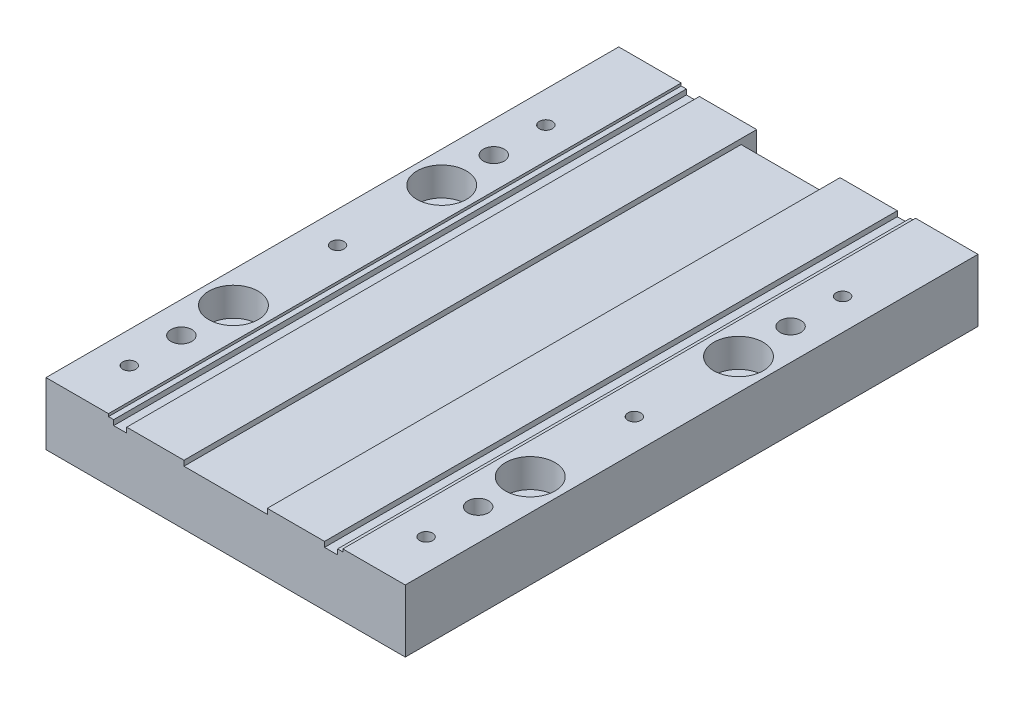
ISO-10303-21;
HEADER;
FILE_DESCRIPTION(('STEP AP214'),'2;1');
FILE_NAME('part.step','',(''),(''),'','','');
FILE_SCHEMA(('AUTOMOTIVE_DESIGN { 1 0 10303 214 1 1 1 1 }'));
ENDSEC;
DATA;
#1=APPLICATION_CONTEXT('core data for automotive mechanical design processes');
#2=APPLICATION_PROTOCOL_DEFINITION('international standard','automotive_design',2000,#1);
#3=PRODUCT_CONTEXT('',#1,'mechanical');
#4=PRODUCT('Part','Part','',(#3));
#5=PRODUCT_RELATED_PRODUCT_CATEGORY('part','',(#4));
#6=PRODUCT_DEFINITION_FORMATION('','',#4);
#7=PRODUCT_DEFINITION_CONTEXT('part definition',#1,'design');
#8=PRODUCT_DEFINITION('design','',#6,#7);
#9=PRODUCT_DEFINITION_SHAPE('','',#8);
#10=(LENGTH_UNIT() NAMED_UNIT(*) SI_UNIT(.MILLI.,.METRE.));
#11=(NAMED_UNIT(*) PLANE_ANGLE_UNIT() SI_UNIT($,.RADIAN.));
#12=(NAMED_UNIT(*) SI_UNIT($,.STERADIAN.) SOLID_ANGLE_UNIT());
#13=UNCERTAINTY_MEASURE_WITH_UNIT(LENGTH_MEASURE(1.E-05),#10,'distance_accuracy_value','');
#14=(GEOMETRIC_REPRESENTATION_CONTEXT(3) GLOBAL_UNCERTAINTY_ASSIGNED_CONTEXT((#13)) GLOBAL_UNIT_ASSIGNED_CONTEXT((#10,
#11,#12)) REPRESENTATION_CONTEXT('',''));
#15=CARTESIAN_POINT('',(0.,0.,0.));
#16=DIRECTION('',(0.,0.,1.));
#17=DIRECTION('',(1.,0.,0.));
#18=AXIS2_PLACEMENT_3D('',#15,#16,#17);
#19=CARTESIAN_POINT('',(6.,-97.9999999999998,40.));
#20=DIRECTION('',(0.,1.,0.));
#21=DIRECTION('',(0.,0.,1.));
#22=AXIS2_PLACEMENT_3D('',#19,#20,#21);
#23=CYLINDRICAL_SURFACE('',#22,2.75);
#24=CARTESIAN_POINT('',(6.,2.22044604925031E-13,40.));
#25=DIRECTION('',(0.,1.,0.));
#26=DIRECTION('',(0.,0.,1.));
#27=AXIS2_PLACEMENT_3D('',#24,#25,#26);
#28=CIRCLE('',#27,2.75);
#29=CARTESIAN_POINT('',(6.,2.22044604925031E-13,42.75));
#30=VERTEX_POINT('',#29);
#31=EDGE_CURVE('E231',#30,#30,#28,.T.);
#32=ORIENTED_EDGE('',*,*,#31,.F.);
#33=EDGE_LOOP('',(#32));
#34=FACE_BOUND('',#33,.T.);
#35=CARTESIAN_POINT('',(6.,6.50000000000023,40.));
#36=DIRECTION('',(0.,1.,0.));
#37=DIRECTION('',(0.,0.,1.));
#38=AXIS2_PLACEMENT_3D('',#35,#36,#37);
#39=CIRCLE('',#38,2.75);
#40=CARTESIAN_POINT('',(6.,6.50000000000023,42.75));
#41=VERTEX_POINT('',#40);
#42=EDGE_CURVE('E249',#41,#41,#39,.F.);
#43=ORIENTED_EDGE('',*,*,#42,.F.);
#44=EDGE_LOOP('',(#43));
#45=FACE_BOUND('',#44,.T.);
#46=ADVANCED_FACE('F32',(#34,#45),#23,.F.);
#47=CARTESIAN_POINT('',(63.,-97.9999999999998,40.));
#48=DIRECTION('',(0.,1.,0.));
#49=DIRECTION('',(0.,0.,1.));
#50=AXIS2_PLACEMENT_3D('',#47,#48,#49);
#51=CYLINDRICAL_SURFACE('',#50,2.75);
#52=CARTESIAN_POINT('',(63.,2.22044604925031E-13,40.));
#53=DIRECTION('',(0.,1.,0.));
#54=DIRECTION('',(0.,0.,1.));
#55=AXIS2_PLACEMENT_3D('',#52,#53,#54);
#56=CIRCLE('',#55,2.75);
#57=CARTESIAN_POINT('',(63.,2.22044604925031E-13,42.75));
#58=VERTEX_POINT('',#57);
#59=EDGE_CURVE('E234',#58,#58,#56,.T.);
#60=ORIENTED_EDGE('',*,*,#59,.F.);
#61=EDGE_LOOP('',(#60));
#62=FACE_BOUND('',#61,.T.);
#63=CARTESIAN_POINT('',(63.,6.50000000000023,40.));
#64=DIRECTION('',(0.,1.,0.));
#65=DIRECTION('',(0.,0.,1.));
#66=AXIS2_PLACEMENT_3D('',#63,#64,#65);
#67=CIRCLE('',#66,2.75);
#68=CARTESIAN_POINT('',(63.,6.50000000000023,42.75));
#69=VERTEX_POINT('',#68);
#70=EDGE_CURVE('E244',#69,#69,#67,.F.);
#71=ORIENTED_EDGE('',*,*,#70,.F.);
#72=EDGE_LOOP('',(#71));
#73=FACE_BOUND('',#72,.T.);
#74=ADVANCED_FACE('F468',(#62,#73),#51,.F.);
#75=CARTESIAN_POINT('',(63.,-97.9999999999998,80.));
#76=DIRECTION('',(0.,1.,0.));
#77=DIRECTION('',(0.,0.,1.));
#78=AXIS2_PLACEMENT_3D('',#75,#76,#77);
#79=CYLINDRICAL_SURFACE('',#78,2.75);
#80=CARTESIAN_POINT('',(63.,2.22044604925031E-13,80.));
#81=DIRECTION('',(0.,1.,0.));
#82=DIRECTION('',(0.,0.,1.));
#83=AXIS2_PLACEMENT_3D('',#80,#81,#82);
#84=CIRCLE('',#83,2.75);
#85=CARTESIAN_POINT('',(63.,2.22044604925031E-13,82.75));
#86=VERTEX_POINT('',#85);
#87=EDGE_CURVE('E230',#86,#86,#84,.T.);
#88=ORIENTED_EDGE('',*,*,#87,.F.);
#89=EDGE_LOOP('',(#88));
#90=FACE_BOUND('',#89,.T.);
#91=CARTESIAN_POINT('',(63.,6.50000000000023,80.));
#92=DIRECTION('',(0.,1.,0.));
#93=DIRECTION('',(0.,0.,1.));
#94=AXIS2_PLACEMENT_3D('',#91,#92,#93);
#95=CIRCLE('',#94,2.75);
#96=CARTESIAN_POINT('',(63.,6.50000000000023,82.75));
#97=VERTEX_POINT('',#96);
#98=EDGE_CURVE('E239',#97,#97,#95,.F.);
#99=ORIENTED_EDGE('',*,*,#98,.F.);
#100=EDGE_LOOP('',(#99));
#101=FACE_BOUND('',#100,.T.);
#102=ADVANCED_FACE('F474',(#90,#101),#79,.F.);
#103=CARTESIAN_POINT('',(6.,-97.9999999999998,80.));
#104=DIRECTION('',(0.,1.,0.));
#105=DIRECTION('',(0.,0.,1.));
#106=AXIS2_PLACEMENT_3D('',#103,#104,#105);
#107=CYLINDRICAL_SURFACE('',#106,2.75);
#108=CARTESIAN_POINT('',(6.,2.22044604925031E-13,80.));
#109=DIRECTION('',(0.,1.,0.));
#110=DIRECTION('',(0.,0.,1.));
#111=AXIS2_PLACEMENT_3D('',#108,#109,#110);
#112=CIRCLE('',#111,2.75);
#113=CARTESIAN_POINT('',(6.,2.22044604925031E-13,82.75));
#114=VERTEX_POINT('',#113);
#115=EDGE_CURVE('E226',#114,#114,#112,.T.);
#116=ORIENTED_EDGE('',*,*,#115,.F.);
#117=EDGE_LOOP('',(#116));
#118=FACE_BOUND('',#117,.T.);
#119=CARTESIAN_POINT('',(6.,6.50000000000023,80.));
#120=DIRECTION('',(0.,1.,0.));
#121=DIRECTION('',(0.,0.,1.));
#122=AXIS2_PLACEMENT_3D('',#119,#120,#121);
#123=CIRCLE('',#122,2.75);
#124=CARTESIAN_POINT('',(6.,6.50000000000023,82.75));
#125=VERTEX_POINT('',#124);
#126=EDGE_CURVE('E235',#125,#125,#123,.F.);
#127=ORIENTED_EDGE('',*,*,#126,.F.);
#128=EDGE_LOOP('',(#127));
#129=FACE_BOUND('',#128,.T.);
#130=ADVANCED_FACE('F485',(#118,#129),#107,.F.);
#131=CARTESIAN_POINT('',(26.5,10.5000000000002,110.));
#132=DIRECTION('',(-1.,0.,0.));
#133=DIRECTION('',(0.,0.,1.));
#134=AXIS2_PLACEMENT_3D('',#131,#132,#133);
#135=PLANE('',#134);
#136=DIRECTION('',(0.,1.,0.));
#137=VECTOR('',#136,1.);
#138=CARTESIAN_POINT('',(26.5,10.5000000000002,0.));
#139=LINE('',#138,#137);
#140=CARTESIAN_POINT('',(26.5,7.50000000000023,0.));
#141=VERTEX_POINT('',#140);
#142=CARTESIAN_POINT('',(26.5,11.5000000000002,0.));
#143=VERTEX_POINT('',#142);
#144=EDGE_CURVE('E47',#141,#143,#139,.T.);
#145=ORIENTED_EDGE('',*,*,#144,.T.);
#146=DIRECTION('',(0.,0.,-1.));
#147=VECTOR('',#146,1.);
#148=CARTESIAN_POINT('',(26.5,11.5000000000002,110.));
#149=LINE('',#148,#147);
#150=CARTESIAN_POINT('',(26.5,11.5000000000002,110.));
#151=VERTEX_POINT('',#150);
#152=EDGE_CURVE('E179',#151,#143,#149,.T.);
#153=ORIENTED_EDGE('',*,*,#152,.F.);
#154=DIRECTION('',(0.,1.,0.));
#155=VECTOR('',#154,1.);
#156=CARTESIAN_POINT('',(26.5,10.5000000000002,110.));
#157=LINE('',#156,#155);
#158=CARTESIAN_POINT('',(26.5,10.5000000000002,110.));
#159=VERTEX_POINT('',#158);
#160=EDGE_CURVE('E185',#159,#151,#157,.T.);
#161=ORIENTED_EDGE('',*,*,#160,.F.);
#162=DIRECTION('',(0.,0.,-1.));
#163=VECTOR('',#162,1.);
#164=CARTESIAN_POINT('',(26.5,10.5000000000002,110.));
#165=LINE('',#164,#163);
#166=CARTESIAN_POINT('',(26.5,10.5000000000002,2.99999999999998));
#167=VERTEX_POINT('',#166);
#168=EDGE_CURVE('E255',#159,#167,#165,.T.);
#169=ORIENTED_EDGE('',*,*,#168,.T.);
#170=DIRECTION('',(0.,-0.707106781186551,-0.707106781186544));
#171=VECTOR('',#170,1.);
#172=CARTESIAN_POINT('',(26.5,64.0000000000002,56.4999999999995));
#173=LINE('',#172,#171);
#174=EDGE_CURVE('E40',#167,#141,#173,.T.);
#175=ORIENTED_EDGE('',*,*,#174,.T.);
#176=EDGE_LOOP('',(#145,#153,#161,#169,#175));
#177=FACE_BOUND('',#176,.T.);
#178=ADVANCED_FACE('F195',(#177),#135,.F.);
#179=CARTESIAN_POINT('',(15.5000000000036,11.5000000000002,110.));
#180=DIRECTION('',(0.,-1.,0.));
#181=DIRECTION('',(0.,0.,-1.));
#182=AXIS2_PLACEMENT_3D('',#179,#180,#181);
#183=PLANE('',#182);
#184=DIRECTION('',(-1.,0.,0.));
#185=VECTOR('',#184,1.);
#186=CARTESIAN_POINT('',(15.5000000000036,11.5000000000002,0.));
#187=LINE('',#186,#185);
#188=CARTESIAN_POINT('',(15.5000000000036,11.5000000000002,0.));
#189=VERTEX_POINT('',#188);
#190=EDGE_CURVE('E333',#143,#189,#187,.T.);
#191=ORIENTED_EDGE('',*,*,#190,.T.);
#192=DIRECTION('',(0.,0.,-1.));
#193=VECTOR('',#192,1.);
#194=CARTESIAN_POINT('',(15.5000000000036,11.5000000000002,110.));
#195=LINE('',#194,#193);
#196=CARTESIAN_POINT('',(15.5000000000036,11.5000000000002,110.));
#197=VERTEX_POINT('',#196);
#198=EDGE_CURVE('E181',#197,#189,#195,.T.);
#199=ORIENTED_EDGE('',*,*,#198,.F.);
#200=DIRECTION('',(-1.,0.,0.));
#201=VECTOR('',#200,1.);
#202=CARTESIAN_POINT('',(15.5000000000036,11.5000000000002,110.));
#203=LINE('',#202,#201);
#204=EDGE_CURVE('E175',#151,#197,#203,.T.);
#205=ORIENTED_EDGE('',*,*,#204,.F.);
#206=ORIENTED_EDGE('',*,*,#152,.T.);
#207=EDGE_LOOP('',(#191,#199,#205,#206));
#208=FACE_BOUND('',#207,.T.);
#209=ADVANCED_FACE('F177',(#208),#183,.F.);
#210=CARTESIAN_POINT('',(15.5000000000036,11.5000000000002,110.));
#211=DIRECTION('',(1.,0.,0.));
#212=DIRECTION('',(0.,0.,-1.));
#213=AXIS2_PLACEMENT_3D('',#210,#211,#212);
#214=PLANE('',#213);
#215=DIRECTION('',(0.,-1.,0.));
#216=VECTOR('',#215,1.);
#217=CARTESIAN_POINT('',(15.5000000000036,11.5000000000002,0.));
#218=LINE('',#217,#216);
#219=CARTESIAN_POINT('',(15.5000000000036,10.5000000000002,0.));
#220=VERTEX_POINT('',#219);
#221=EDGE_CURVE('E327',#189,#220,#218,.T.);
#222=ORIENTED_EDGE('',*,*,#221,.T.);
#223=DIRECTION('',(0.,0.,-1.));
#224=VECTOR('',#223,1.);
#225=CARTESIAN_POINT('',(15.5000000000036,10.5000000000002,110.));
#226=LINE('',#225,#224);
#227=CARTESIAN_POINT('',(15.5000000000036,10.5000000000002,110.));
#228=VERTEX_POINT('',#227);
#229=EDGE_CURVE('E201',#228,#220,#226,.T.);
#230=ORIENTED_EDGE('',*,*,#229,.F.);
#231=DIRECTION('',(0.,-1.,0.));
#232=VECTOR('',#231,1.);
#233=CARTESIAN_POINT('',(15.5000000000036,11.5000000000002,110.));
#234=LINE('',#233,#232);
#235=EDGE_CURVE('E184',#197,#228,#234,.T.);
#236=ORIENTED_EDGE('',*,*,#235,.F.);
#237=ORIENTED_EDGE('',*,*,#198,.T.);
#238=EDGE_LOOP('',(#222,#230,#236,#237));
#239=FACE_BOUND('',#238,.T.);
#240=ADVANCED_FACE('F378',(#239),#214,.F.);
#241=CARTESIAN_POINT('',(13.0000000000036,10.5000000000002,110.));
#242=DIRECTION('',(0.,-1.,0.));
#243=DIRECTION('',(0.,0.,-1.));
#244=AXIS2_PLACEMENT_3D('',#241,#242,#243);
#245=PLANE('',#244);
#246=DIRECTION('',(-1.,0.,0.));
#247=VECTOR('',#246,1.);
#248=CARTESIAN_POINT('',(13.0000000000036,10.5000000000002,0.));
#249=LINE('',#248,#247);
#250=CARTESIAN_POINT('',(13.0000000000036,10.5000000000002,0.));
#251=VERTEX_POINT('',#250);
#252=EDGE_CURVE('E322',#220,#251,#249,.T.);
#253=ORIENTED_EDGE('',*,*,#252,.T.);
#254=DIRECTION('',(0.,0.,-1.));
#255=VECTOR('',#254,1.);
#256=CARTESIAN_POINT('',(13.0000000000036,10.5000000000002,110.));
#257=LINE('',#256,#255);
#258=CARTESIAN_POINT('',(13.0000000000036,10.5000000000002,110.));
#259=VERTEX_POINT('',#258);
#260=EDGE_CURVE('E313',#259,#251,#257,.T.);
#261=ORIENTED_EDGE('',*,*,#260,.F.);
#262=DIRECTION('',(-1.,0.,0.));
#263=VECTOR('',#262,1.);
#264=CARTESIAN_POINT('',(13.0000000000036,10.5000000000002,110.));
#265=LINE('',#264,#263);
#266=EDGE_CURVE('E323',#228,#259,#265,.T.);
#267=ORIENTED_EDGE('',*,*,#266,.F.);
#268=ORIENTED_EDGE('',*,*,#229,.T.);
#269=EDGE_LOOP('',(#253,#261,#267,#268));
#270=FACE_BOUND('',#269,.T.);
#271=ADVANCED_FACE('F320',(#270),#245,.F.);
#272=CARTESIAN_POINT('',(13.0000000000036,11.5000000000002,110.));
#273=DIRECTION('',(-1.,0.,0.));
#274=DIRECTION('',(0.,0.,1.));
#275=AXIS2_PLACEMENT_3D('',#272,#273,#274);
#276=PLANE('',#275);
#277=DIRECTION('',(0.,1.,0.));
#278=VECTOR('',#277,1.);
#279=CARTESIAN_POINT('',(13.0000000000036,11.5000000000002,0.));
#280=LINE('',#279,#278);
#281=CARTESIAN_POINT('',(13.0000000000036,11.5000000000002,0.));
#282=VERTEX_POINT('',#281);
#283=EDGE_CURVE('E329',#251,#282,#280,.T.);
#284=ORIENTED_EDGE('',*,*,#283,.T.);
#285=DIRECTION('',(0.,0.,-1.));
#286=VECTOR('',#285,1.);
#287=CARTESIAN_POINT('',(13.0000000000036,11.5000000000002,110.));
#288=LINE('',#287,#286);
#289=CARTESIAN_POINT('',(13.0000000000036,11.5000000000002,110.));
#290=VERTEX_POINT('',#289);
#291=EDGE_CURVE('E310',#290,#282,#288,.T.);
#292=ORIENTED_EDGE('',*,*,#291,.F.);
#293=DIRECTION('',(0.,1.,0.));
#294=VECTOR('',#293,1.);
#295=CARTESIAN_POINT('',(13.0000000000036,11.5000000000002,110.));
#296=LINE('',#295,#294);
#297=EDGE_CURVE('E380',#259,#290,#296,.T.);
#298=ORIENTED_EDGE('',*,*,#297,.F.);
#299=ORIENTED_EDGE('',*,*,#260,.T.);
#300=EDGE_LOOP('',(#284,#292,#298,#299));
#301=FACE_BOUND('',#300,.T.);
#302=ADVANCED_FACE('F458',(#301),#276,.F.);
#303=CARTESIAN_POINT('',(12.,11.5000000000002,110.));
#304=DIRECTION('',(0.,-1.,0.));
#305=DIRECTION('',(0.,0.,-1.));
#306=AXIS2_PLACEMENT_3D('',#303,#304,#305);
#307=PLANE('',#306);
#308=DIRECTION('',(-1.,0.,0.));
#309=VECTOR('',#308,1.);
#310=CARTESIAN_POINT('',(12.,11.5000000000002,0.));
#311=LINE('',#310,#309);
#312=CARTESIAN_POINT('',(12.,11.5000000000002,0.));
#313=VERTEX_POINT('',#312);
#314=EDGE_CURVE('E331',#282,#313,#311,.T.);
#315=ORIENTED_EDGE('',*,*,#314,.T.);
#316=DIRECTION('',(0.,0.,-1.));
#317=VECTOR('',#316,1.);
#318=CARTESIAN_POINT('',(12.,11.5000000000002,110.));
#319=LINE('',#318,#317);
#320=CARTESIAN_POINT('',(12.,11.5000000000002,110.));
#321=VERTEX_POINT('',#320);
#322=EDGE_CURVE('E307',#321,#313,#319,.T.);
#323=ORIENTED_EDGE('',*,*,#322,.F.);
#324=DIRECTION('',(-1.,0.,0.));
#325=VECTOR('',#324,1.);
#326=CARTESIAN_POINT('',(12.,11.5000000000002,110.));
#327=LINE('',#326,#325);
#328=EDGE_CURVE('E384',#290,#321,#327,.T.);
#329=ORIENTED_EDGE('',*,*,#328,.F.);
#330=ORIENTED_EDGE('',*,*,#291,.T.);
#331=EDGE_LOOP('',(#315,#323,#329,#330));
#332=FACE_BOUND('',#331,.T.);
#333=ADVANCED_FACE('F453',(#332),#307,.F.);
#334=CARTESIAN_POINT('',(12.,11.5000000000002,110.));
#335=DIRECTION('',(-1.,0.,0.));
#336=DIRECTION('',(0.,0.,1.));
#337=AXIS2_PLACEMENT_3D('',#334,#335,#336);
#338=PLANE('',#337);
#339=DIRECTION('',(0.,1.,0.));
#340=VECTOR('',#339,1.);
#341=CARTESIAN_POINT('',(12.,11.5000000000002,0.));
#342=LINE('',#341,#340);
#343=CARTESIAN_POINT('',(12.,12.0000000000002,0.));
#344=VERTEX_POINT('',#343);
#345=EDGE_CURVE('E338',#313,#344,#342,.T.);
#346=ORIENTED_EDGE('',*,*,#345,.T.);
#347=DIRECTION('',(0.,0.,-1.));
#348=VECTOR('',#347,1.);
#349=CARTESIAN_POINT('',(12.,12.0000000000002,110.));
#350=LINE('',#349,#348);
#351=CARTESIAN_POINT('',(12.,12.0000000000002,110.));
#352=VERTEX_POINT('',#351);
#353=EDGE_CURVE('E304',#352,#344,#350,.T.);
#354=ORIENTED_EDGE('',*,*,#353,.F.);
#355=DIRECTION('',(0.,1.,0.));
#356=VECTOR('',#355,1.);
#357=CARTESIAN_POINT('',(12.,11.5000000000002,110.));
#358=LINE('',#357,#356);
#359=EDGE_CURVE('E386',#321,#352,#358,.T.);
#360=ORIENTED_EDGE('',*,*,#359,.F.);
#361=ORIENTED_EDGE('',*,*,#322,.T.);
#362=EDGE_LOOP('',(#346,#354,#360,#361));
#363=FACE_BOUND('',#362,.T.);
#364=ADVANCED_FACE('F450',(#363),#338,.F.);
#365=CARTESIAN_POINT('',(0.,12.0000000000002,110.));
#366=DIRECTION('',(0.,-1.,0.));
#367=DIRECTION('',(0.,0.,-1.));
#368=AXIS2_PLACEMENT_3D('',#365,#366,#367);
#369=PLANE('',#368);
#370=CARTESIAN_POINT('',(6.,12.0000000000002,40.));
#371=DIRECTION('',(0.,1.,0.));
#372=DIRECTION('',(0.,0.,1.));
#373=AXIS2_PLACEMENT_3D('',#370,#371,#372);
#374=CIRCLE('',#373,4.75);
#375=CARTESIAN_POINT('',(6.,12.0000000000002,44.75));
#376=VERTEX_POINT('',#375);
#377=EDGE_CURVE('E873',#376,#376,#374,.T.);
#378=ORIENTED_EDGE('',*,*,#377,.F.);
#379=EDGE_LOOP('',(#378));
#380=FACE_BOUND('',#379,.T.);
#381=CARTESIAN_POINT('',(6.,12.0000000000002,80.));
#382=DIRECTION('',(0.,1.,0.));
#383=DIRECTION('',(0.,0.,1.));
#384=AXIS2_PLACEMENT_3D('',#381,#382,#383);
#385=CIRCLE('',#384,4.75);
#386=CARTESIAN_POINT('',(6.,12.0000000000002,84.75));
#387=VERTEX_POINT('',#386);
#388=EDGE_CURVE('E242',#387,#387,#385,.T.);
#389=ORIENTED_EDGE('',*,*,#388,.F.);
#390=EDGE_LOOP('',(#389));
#391=FACE_BOUND('',#390,.T.);
#392=CARTESIAN_POINT('',(6.,12.0000000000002,90.));
#393=DIRECTION('',(0.,1.,0.));
#394=DIRECTION('',(0.,0.,1.));
#395=AXIS2_PLACEMENT_3D('',#392,#393,#394);
#396=CIRCLE('',#395,2.00000000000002);
#397=CARTESIAN_POINT('',(6.,12.0000000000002,92.));
#398=VERTEX_POINT('',#397);
#399=EDGE_CURVE('E225',#398,#398,#396,.T.);
#400=ORIENTED_EDGE('',*,*,#399,.F.);
#401=EDGE_LOOP('',(#400));
#402=FACE_BOUND('',#401,.T.);
#403=CARTESIAN_POINT('',(6.,12.0000000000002,30.));
#404=DIRECTION('',(0.,1.,0.));
#405=DIRECTION('',(0.,0.,1.));
#406=AXIS2_PLACEMENT_3D('',#403,#404,#405);
#407=CIRCLE('',#406,2.00000000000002);
#408=CARTESIAN_POINT('',(6.,12.0000000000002,32.));
#409=VERTEX_POINT('',#408);
#410=EDGE_CURVE('E221',#409,#409,#407,.T.);
#411=ORIENTED_EDGE('',*,*,#410,.F.);
#412=EDGE_LOOP('',(#411));
#413=FACE_BOUND('',#412,.T.);
#414=CARTESIAN_POINT('',(6.,12.0000000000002,100.));
#415=DIRECTION('',(0.,1.,0.));
#416=DIRECTION('',(0.,0.,1.));
#417=AXIS2_PLACEMENT_3D('',#414,#415,#416);
#418=CIRCLE('',#417,1.25);
#419=CARTESIAN_POINT('',(6.,12.0000000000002,101.25));
#420=VERTEX_POINT('',#419);
#421=EDGE_CURVE('E216',#420,#420,#418,.T.);
#422=ORIENTED_EDGE('',*,*,#421,.F.);
#423=EDGE_LOOP('',(#422));
#424=FACE_BOUND('',#423,.T.);
#425=CARTESIAN_POINT('',(6.,12.0000000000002,60.));
#426=DIRECTION('',(0.,1.,0.));
#427=DIRECTION('',(0.,0.,1.));
#428=AXIS2_PLACEMENT_3D('',#425,#426,#427);
#429=CIRCLE('',#428,1.25);
#430=CARTESIAN_POINT('',(6.,12.0000000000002,61.25));
#431=VERTEX_POINT('',#430);
#432=EDGE_CURVE('E212',#431,#431,#429,.T.);
#433=ORIENTED_EDGE('',*,*,#432,.F.);
#434=EDGE_LOOP('',(#433));
#435=FACE_BOUND('',#434,.T.);
#436=CARTESIAN_POINT('',(6.,12.0000000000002,20.));
#437=DIRECTION('',(0.,1.,0.));
#438=DIRECTION('',(0.,0.,1.));
#439=AXIS2_PLACEMENT_3D('',#436,#437,#438);
#440=CIRCLE('',#439,1.25);
#441=CARTESIAN_POINT('',(6.,12.0000000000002,21.25));
#442=VERTEX_POINT('',#441);
#443=EDGE_CURVE('E208',#442,#442,#440,.T.);
#444=ORIENTED_EDGE('',*,*,#443,.F.);
#445=EDGE_LOOP('',(#444));
#446=FACE_BOUND('',#445,.T.);
#447=DIRECTION('',(-1.,0.,0.));
#448=VECTOR('',#447,1.);
#449=CARTESIAN_POINT('',(0.,12.0000000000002,0.));
#450=LINE('',#449,#448);
#451=CARTESIAN_POINT('',(0.,12.0000000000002,0.));
#452=VERTEX_POINT('',#451);
#453=EDGE_CURVE('E340',#344,#452,#450,.T.);
#454=ORIENTED_EDGE('',*,*,#453,.T.);
#455=DIRECTION('',(0.,0.,-1.));
#456=VECTOR('',#455,1.);
#457=CARTESIAN_POINT('',(0.,12.0000000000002,110.));
#458=LINE('',#457,#456);
#459=CARTESIAN_POINT('',(0.,12.0000000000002,110.));
#460=VERTEX_POINT('',#459);
#461=EDGE_CURVE('E301',#460,#452,#458,.T.);
#462=ORIENTED_EDGE('',*,*,#461,.F.);
#463=DIRECTION('',(-1.,0.,0.));
#464=VECTOR('',#463,1.);
#465=CARTESIAN_POINT('',(0.,12.0000000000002,110.));
#466=LINE('',#465,#464);
#467=EDGE_CURVE('E388',#352,#460,#466,.T.);
#468=ORIENTED_EDGE('',*,*,#467,.F.);
#469=ORIENTED_EDGE('',*,*,#353,.T.);
#470=EDGE_LOOP('',(#454,#462,#468,#469));
#471=FACE_BOUND('',#470,.T.);
#472=ADVANCED_FACE('F446',(#380,#391,#402,#413,#424,#435,#446,#471),#369,.F.);
#473=CARTESIAN_POINT('',(0.,2.27373675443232E-13,110.));
#474=DIRECTION('',(1.,0.,0.));
#475=DIRECTION('',(0.,0.,-1.));
#476=AXIS2_PLACEMENT_3D('',#473,#474,#475);
#477=PLANE('',#476);
#478=DIRECTION('',(0.,-1.,0.));
#479=VECTOR('',#478,1.);
#480=CARTESIAN_POINT('',(0.,2.27373675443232E-13,0.));
#481=LINE('',#480,#479);
#482=CARTESIAN_POINT('',(0.,2.27373675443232E-13,0.));
#483=VERTEX_POINT('',#482);
#484=EDGE_CURVE('E342',#452,#483,#481,.T.);
#485=ORIENTED_EDGE('',*,*,#484,.T.);
#486=DIRECTION('',(0.,0.,-1.));
#487=VECTOR('',#486,1.);
#488=CARTESIAN_POINT('',(0.,2.27373675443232E-13,110.));
#489=LINE('',#488,#487);
#490=CARTESIAN_POINT('',(0.,2.27373675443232E-13,110.));
#491=VERTEX_POINT('',#490);
#492=EDGE_CURVE('E298',#491,#483,#489,.T.);
#493=ORIENTED_EDGE('',*,*,#492,.F.);
#494=DIRECTION('',(0.,-1.,0.));
#495=VECTOR('',#494,1.);
#496=CARTESIAN_POINT('',(0.,2.27373675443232E-13,110.));
#497=LINE('',#496,#495);
#498=EDGE_CURVE('E390',#460,#491,#497,.T.);
#499=ORIENTED_EDGE('',*,*,#498,.F.);
#500=ORIENTED_EDGE('',*,*,#461,.T.);
#501=EDGE_LOOP('',(#485,#493,#499,#500));
#502=FACE_BOUND('',#501,.T.);
#503=ADVANCED_FACE('F441',(#502),#477,.F.);
#504=CARTESIAN_POINT('',(0.,2.27373675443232E-13,110.));
#505=DIRECTION('',(0.,1.,0.));
#506=DIRECTION('',(0.,0.,1.));
#507=AXIS2_PLACEMENT_3D('',#504,#505,#506);
#508=PLANE('',#507);
#509=ORIENTED_EDGE('',*,*,#31,.T.);
#510=EDGE_LOOP('',(#509));
#511=FACE_BOUND('',#510,.T.);
#512=ORIENTED_EDGE('',*,*,#59,.T.);
#513=EDGE_LOOP('',(#512));
#514=FACE_BOUND('',#513,.T.);
#515=ORIENTED_EDGE('',*,*,#87,.T.);
#516=EDGE_LOOP('',(#515));
#517=FACE_BOUND('',#516,.T.);
#518=ORIENTED_EDGE('',*,*,#115,.T.);
#519=EDGE_LOOP('',(#518));
#520=FACE_BOUND('',#519,.T.);
#521=CARTESIAN_POINT('',(63.,2.22044604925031E-13,30.));
#522=DIRECTION('',(0.,1.,0.));
#523=DIRECTION('',(0.,0.,1.));
#524=AXIS2_PLACEMENT_3D('',#521,#522,#523);
#525=CIRCLE('',#524,2.00000000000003);
#526=CARTESIAN_POINT('',(63.,2.22044604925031E-13,32.));
#527=VERTEX_POINT('',#526);
#528=EDGE_CURVE('E895',#527,#527,#525,.T.);
#529=ORIENTED_EDGE('',*,*,#528,.T.);
#530=EDGE_LOOP('',(#529));
#531=FACE_BOUND('',#530,.T.);
#532=CARTESIAN_POINT('',(63.,2.22044604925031E-13,90.));
#533=DIRECTION('',(0.,1.,0.));
#534=DIRECTION('',(0.,0.,1.));
#535=AXIS2_PLACEMENT_3D('',#532,#533,#534);
#536=CIRCLE('',#535,2.00000000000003);
#537=CARTESIAN_POINT('',(63.,2.22044604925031E-13,92.));
#538=VERTEX_POINT('',#537);
#539=EDGE_CURVE('E901',#538,#538,#536,.T.);
#540=ORIENTED_EDGE('',*,*,#539,.T.);
#541=EDGE_LOOP('',(#540));
#542=FACE_BOUND('',#541,.T.);
#543=CARTESIAN_POINT('',(6.,2.22044604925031E-13,90.));
#544=DIRECTION('',(0.,1.,0.));
#545=DIRECTION('',(0.,0.,1.));
#546=AXIS2_PLACEMENT_3D('',#543,#544,#545);
#547=CIRCLE('',#546,2.00000000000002);
#548=CARTESIAN_POINT('',(6.,2.22044604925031E-13,92.));
#549=VERTEX_POINT('',#548);
#550=EDGE_CURVE('E222',#549,#549,#547,.T.);
#551=ORIENTED_EDGE('',*,*,#550,.T.);
#552=EDGE_LOOP('',(#551));
#553=FACE_BOUND('',#552,.T.);
#554=CARTESIAN_POINT('',(6.,2.22044604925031E-13,30.));
#555=DIRECTION('',(0.,1.,0.));
#556=DIRECTION('',(0.,0.,1.));
#557=AXIS2_PLACEMENT_3D('',#554,#555,#556);
#558=CIRCLE('',#557,2.00000000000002);
#559=CARTESIAN_POINT('',(6.,2.22044604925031E-13,32.));
#560=VERTEX_POINT('',#559);
#561=EDGE_CURVE('E217',#560,#560,#558,.T.);
#562=ORIENTED_EDGE('',*,*,#561,.T.);
#563=EDGE_LOOP('',(#562));
#564=FACE_BOUND('',#563,.T.);
#565=CARTESIAN_POINT('',(63.,2.22044604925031E-13,20.));
#566=DIRECTION('',(0.,1.,0.));
#567=DIRECTION('',(0.,0.,1.));
#568=AXIS2_PLACEMENT_3D('',#565,#566,#567);
#569=CIRCLE('',#568,1.25);
#570=CARTESIAN_POINT('',(63.,2.22044604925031E-13,21.25));
#571=VERTEX_POINT('',#570);
#572=EDGE_CURVE('E910',#571,#571,#569,.T.);
#573=ORIENTED_EDGE('',*,*,#572,.T.);
#574=EDGE_LOOP('',(#573));
#575=FACE_BOUND('',#574,.T.);
#576=CARTESIAN_POINT('',(63.,2.22044604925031E-13,60.));
#577=DIRECTION('',(0.,1.,0.));
#578=DIRECTION('',(0.,0.,1.));
#579=AXIS2_PLACEMENT_3D('',#576,#577,#578);
#580=CIRCLE('',#579,1.25);
#581=CARTESIAN_POINT('',(63.,2.22044604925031E-13,61.25));
#582=VERTEX_POINT('',#581);
#583=EDGE_CURVE('E916',#582,#582,#580,.T.);
#584=ORIENTED_EDGE('',*,*,#583,.T.);
#585=EDGE_LOOP('',(#584));
#586=FACE_BOUND('',#585,.T.);
#587=CARTESIAN_POINT('',(63.,2.22044604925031E-13,100.));
#588=DIRECTION('',(0.,1.,0.));
#589=DIRECTION('',(0.,0.,1.));
#590=AXIS2_PLACEMENT_3D('',#587,#588,#589);
#591=CIRCLE('',#590,1.25);
#592=CARTESIAN_POINT('',(63.,2.22044604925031E-13,101.25));
#593=VERTEX_POINT('',#592);
#594=EDGE_CURVE('E922',#593,#593,#591,.T.);
#595=ORIENTED_EDGE('',*,*,#594,.T.);
#596=EDGE_LOOP('',(#595));
#597=FACE_BOUND('',#596,.T.);
#598=CARTESIAN_POINT('',(6.,2.22044604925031E-13,100.));
#599=DIRECTION('',(0.,1.,0.));
#600=DIRECTION('',(0.,0.,1.));
#601=AXIS2_PLACEMENT_3D('',#598,#599,#600);
#602=CIRCLE('',#601,1.25);
#603=CARTESIAN_POINT('',(6.,2.22044604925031E-13,101.25));
#604=VERTEX_POINT('',#603);
#605=EDGE_CURVE('E213',#604,#604,#602,.T.);
#606=ORIENTED_EDGE('',*,*,#605,.T.);
#607=EDGE_LOOP('',(#606));
#608=FACE_BOUND('',#607,.T.);
#609=CARTESIAN_POINT('',(6.,2.22044604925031E-13,60.));
#610=DIRECTION('',(0.,1.,0.));
#611=DIRECTION('',(0.,0.,1.));
#612=AXIS2_PLACEMENT_3D('',#609,#610,#611);
#613=CIRCLE('',#612,1.25);
#614=CARTESIAN_POINT('',(6.,2.22044604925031E-13,61.25));
#615=VERTEX_POINT('',#614);
#616=EDGE_CURVE('E209',#615,#615,#613,.T.);
#617=ORIENTED_EDGE('',*,*,#616,.T.);
#618=EDGE_LOOP('',(#617));
#619=FACE_BOUND('',#618,.T.);
#620=CARTESIAN_POINT('',(6.,2.22044604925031E-13,20.));
#621=DIRECTION('',(0.,1.,0.));
#622=DIRECTION('',(0.,0.,1.));
#623=AXIS2_PLACEMENT_3D('',#620,#621,#622);
#624=CIRCLE('',#623,1.25);
#625=CARTESIAN_POINT('',(6.,2.22044604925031E-13,21.25));
#626=VERTEX_POINT('',#625);
#627=EDGE_CURVE('E205',#626,#626,#624,.T.);
#628=ORIENTED_EDGE('',*,*,#627,.T.);
#629=EDGE_LOOP('',(#628));
#630=FACE_BOUND('',#629,.T.);
#631=DIRECTION('',(1.,0.,0.));
#632=VECTOR('',#631,1.);
#633=CARTESIAN_POINT('',(0.,2.27373675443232E-13,0.));
#634=LINE('',#633,#632);
#635=CARTESIAN_POINT('',(69.,2.27373675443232E-13,0.));
#636=VERTEX_POINT('',#635);
#637=EDGE_CURVE('E344',#483,#636,#634,.T.);
#638=ORIENTED_EDGE('',*,*,#637,.T.);
#639=DIRECTION('',(0.,0.,-1.));
#640=VECTOR('',#639,1.);
#641=CARTESIAN_POINT('',(69.,2.27373675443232E-13,110.));
#642=LINE('',#641,#640);
#643=CARTESIAN_POINT('',(69.,2.27373675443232E-13,110.));
#644=VERTEX_POINT('',#643);
#645=EDGE_CURVE('E295',#644,#636,#642,.T.);
#646=ORIENTED_EDGE('',*,*,#645,.F.);
#647=DIRECTION('',(1.,0.,0.));
#648=VECTOR('',#647,1.);
#649=CARTESIAN_POINT('',(0.,2.27373675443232E-13,110.));
#650=LINE('',#649,#648);
#651=EDGE_CURVE('E392',#491,#644,#650,.T.);
#652=ORIENTED_EDGE('',*,*,#651,.F.);
#653=ORIENTED_EDGE('',*,*,#492,.T.);
#654=EDGE_LOOP('',(#638,#646,#652,#653));
#655=FACE_BOUND('',#654,.T.);
#656=ADVANCED_FACE('F435',(#511,#514,#517,#520,#531,#542,#553,#564,#575,#586,#597,#608,#619,
#630,#655),#508,.F.);
#657=CARTESIAN_POINT('',(69.,2.27373675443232E-13,110.));
#658=DIRECTION('',(-1.,0.,0.));
#659=DIRECTION('',(0.,0.,1.));
#660=AXIS2_PLACEMENT_3D('',#657,#658,#659);
#661=PLANE('',#660);
#662=DIRECTION('',(0.,1.,0.));
#663=VECTOR('',#662,1.);
#664=CARTESIAN_POINT('',(69.,2.27373675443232E-13,0.));
#665=LINE('',#664,#663);
#666=CARTESIAN_POINT('',(69.,12.0000000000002,0.));
#667=VERTEX_POINT('',#666);
#668=EDGE_CURVE('E346',#636,#667,#665,.T.);
#669=ORIENTED_EDGE('',*,*,#668,.T.);
#670=DIRECTION('',(0.,0.,-1.));
#671=VECTOR('',#670,1.);
#672=CARTESIAN_POINT('',(69.,12.0000000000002,110.));
#673=LINE('',#672,#671);
#674=CARTESIAN_POINT('',(69.,12.0000000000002,110.));
#675=VERTEX_POINT('',#674);
#676=EDGE_CURVE('E292',#675,#667,#673,.T.);
#677=ORIENTED_EDGE('',*,*,#676,.F.);
#678=DIRECTION('',(0.,1.,0.));
#679=VECTOR('',#678,1.);
#680=CARTESIAN_POINT('',(69.,2.27373675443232E-13,110.));
#681=LINE('',#680,#679);
#682=EDGE_CURVE('E394',#644,#675,#681,.T.);
#683=ORIENTED_EDGE('',*,*,#682,.F.);
#684=ORIENTED_EDGE('',*,*,#645,.T.);
#685=EDGE_LOOP('',(#669,#677,#683,#684));
#686=FACE_BOUND('',#685,.T.);
#687=ADVANCED_FACE('F431',(#686),#661,.F.);
#688=CARTESIAN_POINT('',(57.,12.0000000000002,110.));
#689=DIRECTION('',(0.,-1.,0.));
#690=DIRECTION('',(0.,0.,-1.));
#691=AXIS2_PLACEMENT_3D('',#688,#689,#690);
#692=PLANE('',#691);
#693=CARTESIAN_POINT('',(63.,12.0000000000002,40.));
#694=DIRECTION('',(0.,1.,0.));
#695=DIRECTION('',(0.,0.,1.));
#696=AXIS2_PLACEMENT_3D('',#693,#694,#695);
#697=CIRCLE('',#696,4.75);
#698=CARTESIAN_POINT('',(63.,12.0000000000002,44.75));
#699=VERTEX_POINT('',#698);
#700=EDGE_CURVE('E251',#699,#699,#697,.T.);
#701=ORIENTED_EDGE('',*,*,#700,.F.);
#702=EDGE_LOOP('',(#701));
#703=FACE_BOUND('',#702,.T.);
#704=CARTESIAN_POINT('',(63.,12.0000000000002,80.));
#705=DIRECTION('',(0.,1.,0.));
#706=DIRECTION('',(0.,0.,1.));
#707=AXIS2_PLACEMENT_3D('',#704,#705,#706);
#708=CIRCLE('',#707,4.75);
#709=CARTESIAN_POINT('',(63.,12.0000000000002,84.75));
#710=VERTEX_POINT('',#709);
#711=EDGE_CURVE('E247',#710,#710,#708,.T.);
#712=ORIENTED_EDGE('',*,*,#711,.F.);
#713=EDGE_LOOP('',(#712));
#714=FACE_BOUND('',#713,.T.);
#715=CARTESIAN_POINT('',(63.,12.0000000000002,30.));
#716=DIRECTION('',(0.,1.,0.));
#717=DIRECTION('',(0.,0.,1.));
#718=AXIS2_PLACEMENT_3D('',#715,#716,#717);
#719=CIRCLE('',#718,2.00000000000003);
#720=CARTESIAN_POINT('',(63.,12.0000000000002,32.));
#721=VERTEX_POINT('',#720);
#722=EDGE_CURVE('E229',#721,#721,#719,.T.);
#723=ORIENTED_EDGE('',*,*,#722,.F.);
#724=EDGE_LOOP('',(#723));
#725=FACE_BOUND('',#724,.T.);
#726=CARTESIAN_POINT('',(63.,12.0000000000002,90.));
#727=DIRECTION('',(0.,1.,0.));
#728=DIRECTION('',(0.,0.,1.));
#729=AXIS2_PLACEMENT_3D('',#726,#727,#728);
#730=CIRCLE('',#729,2.00000000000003);
#731=CARTESIAN_POINT('',(63.,12.0000000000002,92.));
#732=VERTEX_POINT('',#731);
#733=EDGE_CURVE('E898',#732,#732,#730,.T.);
#734=ORIENTED_EDGE('',*,*,#733,.F.);
#735=EDGE_LOOP('',(#734));
#736=FACE_BOUND('',#735,.T.);
#737=CARTESIAN_POINT('',(63.,12.0000000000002,20.));
#738=DIRECTION('',(0.,1.,0.));
#739=DIRECTION('',(0.,0.,1.));
#740=AXIS2_PLACEMENT_3D('',#737,#738,#739);
#741=CIRCLE('',#740,1.25);
#742=CARTESIAN_POINT('',(63.,12.0000000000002,21.25));
#743=VERTEX_POINT('',#742);
#744=EDGE_CURVE('E220',#743,#743,#741,.T.);
#745=ORIENTED_EDGE('',*,*,#744,.F.);
#746=EDGE_LOOP('',(#745));
#747=FACE_BOUND('',#746,.T.);
#748=CARTESIAN_POINT('',(63.,12.0000000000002,60.));
#749=DIRECTION('',(0.,1.,0.));
#750=DIRECTION('',(0.,0.,1.));
#751=AXIS2_PLACEMENT_3D('',#748,#749,#750);
#752=CIRCLE('',#751,1.25);
#753=CARTESIAN_POINT('',(63.,12.0000000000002,61.25));
#754=VERTEX_POINT('',#753);
#755=EDGE_CURVE('E913',#754,#754,#752,.T.);
#756=ORIENTED_EDGE('',*,*,#755,.F.);
#757=EDGE_LOOP('',(#756));
#758=FACE_BOUND('',#757,.T.);
#759=CARTESIAN_POINT('',(63.,12.0000000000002,100.));
#760=DIRECTION('',(0.,1.,0.));
#761=DIRECTION('',(0.,0.,1.));
#762=AXIS2_PLACEMENT_3D('',#759,#760,#761);
#763=CIRCLE('',#762,1.25);
#764=CARTESIAN_POINT('',(63.,12.0000000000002,101.25));
#765=VERTEX_POINT('',#764);
#766=EDGE_CURVE('E919',#765,#765,#763,.T.);
#767=ORIENTED_EDGE('',*,*,#766,.F.);
#768=EDGE_LOOP('',(#767));
#769=FACE_BOUND('',#768,.T.);
#770=DIRECTION('',(-1.,0.,0.));
#771=VECTOR('',#770,1.);
#772=CARTESIAN_POINT('',(57.,12.0000000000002,0.));
#773=LINE('',#772,#771);
#774=CARTESIAN_POINT('',(57.,12.0000000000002,0.));
#775=VERTEX_POINT('',#774);
#776=EDGE_CURVE('E348',#667,#775,#773,.T.);
#777=ORIENTED_EDGE('',*,*,#776,.T.);
#778=DIRECTION('',(0.,0.,-1.));
#779=VECTOR('',#778,1.);
#780=CARTESIAN_POINT('',(57.,12.0000000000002,110.));
#781=LINE('',#780,#779);
#782=CARTESIAN_POINT('',(57.,12.0000000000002,110.));
#783=VERTEX_POINT('',#782);
#784=EDGE_CURVE('E289',#783,#775,#781,.T.);
#785=ORIENTED_EDGE('',*,*,#784,.F.);
#786=DIRECTION('',(-1.,0.,0.));
#787=VECTOR('',#786,1.);
#788=CARTESIAN_POINT('',(57.,12.0000000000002,110.));
#789=LINE('',#788,#787);
#790=EDGE_CURVE('E396',#675,#783,#789,.T.);
#791=ORIENTED_EDGE('',*,*,#790,.F.);
#792=ORIENTED_EDGE('',*,*,#676,.T.);
#793=EDGE_LOOP('',(#777,#785,#791,#792));
#794=FACE_BOUND('',#793,.T.);
#795=ADVANCED_FACE('F426',(#703,#714,#725,#736,#747,#758,#769,#794),#692,.F.);
#796=CARTESIAN_POINT('',(57.,11.5000000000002,110.));
#797=DIRECTION('',(1.,0.,0.));
#798=DIRECTION('',(0.,0.,-1.));
#799=AXIS2_PLACEMENT_3D('',#796,#797,#798);
#800=PLANE('',#799);
#801=DIRECTION('',(0.,-1.,0.));
#802=VECTOR('',#801,1.);
#803=CARTESIAN_POINT('',(57.,11.5000000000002,0.));
#804=LINE('',#803,#802);
#805=CARTESIAN_POINT('',(57.,11.5000000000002,0.));
#806=VERTEX_POINT('',#805);
#807=EDGE_CURVE('E350',#775,#806,#804,.T.);
#808=ORIENTED_EDGE('',*,*,#807,.T.);
#809=DIRECTION('',(0.,0.,-1.));
#810=VECTOR('',#809,1.);
#811=CARTESIAN_POINT('',(57.,11.5000000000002,110.));
#812=LINE('',#811,#810);
#813=CARTESIAN_POINT('',(57.,11.5000000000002,110.));
#814=VERTEX_POINT('',#813);
#815=EDGE_CURVE('E286',#814,#806,#812,.T.);
#816=ORIENTED_EDGE('',*,*,#815,.F.);
#817=DIRECTION('',(0.,-1.,0.));
#818=VECTOR('',#817,1.);
#819=CARTESIAN_POINT('',(57.,11.5000000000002,110.));
#820=LINE('',#819,#818);
#821=EDGE_CURVE('E398',#783,#814,#820,.T.);
#822=ORIENTED_EDGE('',*,*,#821,.F.);
#823=ORIENTED_EDGE('',*,*,#784,.T.);
#824=EDGE_LOOP('',(#808,#816,#822,#823));
#825=FACE_BOUND('',#824,.T.);
#826=ADVANCED_FACE('F420',(#825),#800,.F.);
#827=CARTESIAN_POINT('',(56.0000000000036,11.5000000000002,110.));
#828=DIRECTION('',(0.,-1.,0.));
#829=DIRECTION('',(0.,0.,-1.));
#830=AXIS2_PLACEMENT_3D('',#827,#828,#829);
#831=PLANE('',#830);
#832=DIRECTION('',(-1.,0.,0.));
#833=VECTOR('',#832,1.);
#834=CARTESIAN_POINT('',(56.0000000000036,11.5000000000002,0.));
#835=LINE('',#834,#833);
#836=CARTESIAN_POINT('',(56.0000000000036,11.5000000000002,0.));
#837=VERTEX_POINT('',#836);
#838=EDGE_CURVE('E352',#806,#837,#835,.T.);
#839=ORIENTED_EDGE('',*,*,#838,.T.);
#840=DIRECTION('',(0.,0.,-1.));
#841=VECTOR('',#840,1.);
#842=CARTESIAN_POINT('',(56.0000000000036,11.5000000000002,110.));
#843=LINE('',#842,#841);
#844=CARTESIAN_POINT('',(56.0000000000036,11.5000000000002,110.));
#845=VERTEX_POINT('',#844);
#846=EDGE_CURVE('E283',#845,#837,#843,.T.);
#847=ORIENTED_EDGE('',*,*,#846,.F.);
#848=DIRECTION('',(-1.,0.,0.));
#849=VECTOR('',#848,1.);
#850=CARTESIAN_POINT('',(56.0000000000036,11.5000000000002,110.));
#851=LINE('',#850,#849);
#852=EDGE_CURVE('E400',#814,#845,#851,.T.);
#853=ORIENTED_EDGE('',*,*,#852,.F.);
#854=ORIENTED_EDGE('',*,*,#815,.T.);
#855=EDGE_LOOP('',(#839,#847,#853,#854));
#856=FACE_BOUND('',#855,.T.);
#857=ADVANCED_FACE('F416',(#856),#831,.F.);
#858=CARTESIAN_POINT('',(56.0000000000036,11.5000000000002,110.));
#859=DIRECTION('',(1.,0.,0.));
#860=DIRECTION('',(0.,0.,-1.));
#861=AXIS2_PLACEMENT_3D('',#858,#859,#860);
#862=PLANE('',#861);
#863=DIRECTION('',(0.,-1.,0.));
#864=VECTOR('',#863,1.);
#865=CARTESIAN_POINT('',(56.0000000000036,11.5000000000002,0.));
#866=LINE('',#865,#864);
#867=CARTESIAN_POINT('',(56.0000000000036,10.5000000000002,0.));
#868=VERTEX_POINT('',#867);
#869=EDGE_CURVE('E354',#837,#868,#866,.T.);
#870=ORIENTED_EDGE('',*,*,#869,.T.);
#871=DIRECTION('',(0.,0.,-1.));
#872=VECTOR('',#871,1.);
#873=CARTESIAN_POINT('',(56.0000000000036,10.5000000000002,110.));
#874=LINE('',#873,#872);
#875=CARTESIAN_POINT('',(56.0000000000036,10.5000000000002,110.));
#876=VERTEX_POINT('',#875);
#877=EDGE_CURVE('E280',#876,#868,#874,.T.);
#878=ORIENTED_EDGE('',*,*,#877,.F.);
#879=DIRECTION('',(0.,-1.,0.));
#880=VECTOR('',#879,1.);
#881=CARTESIAN_POINT('',(56.0000000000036,11.5000000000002,110.));
#882=LINE('',#881,#880);
#883=EDGE_CURVE('E402',#845,#876,#882,.T.);
#884=ORIENTED_EDGE('',*,*,#883,.F.);
#885=ORIENTED_EDGE('',*,*,#846,.T.);
#886=EDGE_LOOP('',(#870,#878,#884,#885));
#887=FACE_BOUND('',#886,.T.);
#888=ADVANCED_FACE('F412',(#887),#862,.F.);
#889=CARTESIAN_POINT('',(53.5000000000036,10.5000000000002,110.));
#890=DIRECTION('',(0.,-1.,0.));
#891=DIRECTION('',(0.,0.,-1.));
#892=AXIS2_PLACEMENT_3D('',#889,#890,#891);
#893=PLANE('',#892);
#894=DIRECTION('',(-1.,0.,0.));
#895=VECTOR('',#894,1.);
#896=CARTESIAN_POINT('',(53.5000000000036,10.5000000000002,0.));
#897=LINE('',#896,#895);
#898=CARTESIAN_POINT('',(53.5000000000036,10.5000000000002,0.));
#899=VERTEX_POINT('',#898);
#900=EDGE_CURVE('E356',#868,#899,#897,.T.);
#901=ORIENTED_EDGE('',*,*,#900,.T.);
#902=DIRECTION('',(0.,0.,-1.));
#903=VECTOR('',#902,1.);
#904=CARTESIAN_POINT('',(53.5000000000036,10.5000000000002,110.));
#905=LINE('',#904,#903);
#906=CARTESIAN_POINT('',(53.5000000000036,10.5000000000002,110.));
#907=VERTEX_POINT('',#906);
#908=EDGE_CURVE('E277',#907,#899,#905,.T.);
#909=ORIENTED_EDGE('',*,*,#908,.F.);
#910=DIRECTION('',(-1.,0.,0.));
#911=VECTOR('',#910,1.);
#912=CARTESIAN_POINT('',(53.5000000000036,10.5000000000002,110.));
#913=LINE('',#912,#911);
#914=EDGE_CURVE('E373',#876,#907,#913,.T.);
#915=ORIENTED_EDGE('',*,*,#914,.F.);
#916=ORIENTED_EDGE('',*,*,#877,.T.);
#917=EDGE_LOOP('',(#901,#909,#915,#916));
#918=FACE_BOUND('',#917,.T.);
#919=ADVANCED_FACE('F407',(#918),#893,.F.);
#920=CARTESIAN_POINT('',(53.5000000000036,11.5000000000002,110.));
#921=DIRECTION('',(-1.,0.,0.));
#922=DIRECTION('',(0.,0.,1.));
#923=AXIS2_PLACEMENT_3D('',#920,#921,#922);
#924=PLANE('',#923);
#925=DIRECTION('',(0.,1.,0.));
#926=VECTOR('',#925,1.);
#927=CARTESIAN_POINT('',(53.5000000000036,11.5000000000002,0.));
#928=LINE('',#927,#926);
#929=CARTESIAN_POINT('',(53.5000000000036,11.5000000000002,0.));
#930=VERTEX_POINT('',#929);
#931=EDGE_CURVE('E264',#899,#930,#928,.T.);
#932=ORIENTED_EDGE('',*,*,#931,.T.);
#933=DIRECTION('',(0.,0.,-1.));
#934=VECTOR('',#933,1.);
#935=CARTESIAN_POINT('',(53.5000000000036,11.5000000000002,110.));
#936=LINE('',#935,#934);
#937=CARTESIAN_POINT('',(53.5000000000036,11.5000000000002,110.));
#938=VERTEX_POINT('',#937);
#939=EDGE_CURVE('E274',#938,#930,#936,.T.);
#940=ORIENTED_EDGE('',*,*,#939,.F.);
#941=DIRECTION('',(0.,1.,0.));
#942=VECTOR('',#941,1.);
#943=CARTESIAN_POINT('',(53.5000000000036,11.5000000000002,110.));
#944=LINE('',#943,#942);
#945=EDGE_CURVE('E370',#907,#938,#944,.T.);
#946=ORIENTED_EDGE('',*,*,#945,.F.);
#947=ORIENTED_EDGE('',*,*,#908,.T.);
#948=EDGE_LOOP('',(#932,#940,#946,#947));
#949=FACE_BOUND('',#948,.T.);
#950=ADVANCED_FACE('F359',(#949),#924,.F.);
#951=CARTESIAN_POINT('',(42.5,11.5000000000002,110.));
#952=DIRECTION('',(0.,-1.,0.));
#953=DIRECTION('',(0.,0.,-1.));
#954=AXIS2_PLACEMENT_3D('',#951,#952,#953);
#955=PLANE('',#954);
#956=DIRECTION('',(-1.,0.,0.));
#957=VECTOR('',#956,1.);
#958=CARTESIAN_POINT('',(42.5,11.5000000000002,0.));
#959=LINE('',#958,#957);
#960=CARTESIAN_POINT('',(42.5,11.5000000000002,0.));
#961=VERTEX_POINT('',#960);
#962=EDGE_CURVE('E262',#930,#961,#959,.T.);
#963=ORIENTED_EDGE('',*,*,#962,.T.);
#964=DIRECTION('',(0.,0.,-1.));
#965=VECTOR('',#964,1.);
#966=CARTESIAN_POINT('',(42.5,11.5000000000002,110.));
#967=LINE('',#966,#965);
#968=CARTESIAN_POINT('',(42.5,11.5000000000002,110.));
#969=VERTEX_POINT('',#968);
#970=EDGE_CURVE('E272',#969,#961,#967,.T.);
#971=ORIENTED_EDGE('',*,*,#970,.F.);
#972=DIRECTION('',(-1.,0.,0.));
#973=VECTOR('',#972,1.);
#974=CARTESIAN_POINT('',(42.5,11.5000000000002,110.));
#975=LINE('',#974,#973);
#976=EDGE_CURVE('E367',#938,#969,#975,.T.);
#977=ORIENTED_EDGE('',*,*,#976,.F.);
#978=ORIENTED_EDGE('',*,*,#939,.T.);
#979=EDGE_LOOP('',(#963,#971,#977,#978));
#980=FACE_BOUND('',#979,.T.);
#981=ADVANCED_FACE('F365',(#980),#955,.F.);
#982=CARTESIAN_POINT('',(42.5,10.5000000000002,110.));
#983=DIRECTION('',(1.,0.,0.));
#984=DIRECTION('',(0.,0.,-1.));
#985=AXIS2_PLACEMENT_3D('',#982,#983,#984);
#986=PLANE('',#985);
#987=DIRECTION('',(0.,-1.,0.));
#988=VECTOR('',#987,1.);
#989=CARTESIAN_POINT('',(42.5,10.5000000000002,0.));
#990=LINE('',#989,#988);
#991=CARTESIAN_POINT('',(42.5,7.50000000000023,0.));
#992=VERTEX_POINT('',#991);
#993=EDGE_CURVE('E54',#961,#992,#990,.T.);
#994=ORIENTED_EDGE('',*,*,#993,.T.);
#995=DIRECTION('',(0.,0.707106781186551,0.707106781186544));
#996=VECTOR('',#995,1.);
#997=CARTESIAN_POINT('',(42.5,64.0000000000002,56.4999999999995));
#998=LINE('',#997,#996);
#999=CARTESIAN_POINT('',(42.5,10.5000000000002,2.99999999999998));
#1000=VERTEX_POINT('',#999);
#1001=EDGE_CURVE('E11',#992,#1000,#998,.T.);
#1002=ORIENTED_EDGE('',*,*,#1001,.T.);
#1003=DIRECTION('',(0.,0.,-1.));
#1004=VECTOR('',#1003,1.);
#1005=CARTESIAN_POINT('',(42.5,10.5000000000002,110.));
#1006=LINE('',#1005,#1004);
#1007=CARTESIAN_POINT('',(42.5,10.5000000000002,110.));
#1008=VERTEX_POINT('',#1007);
#1009=EDGE_CURVE('E269',#1008,#1000,#1006,.T.);
#1010=ORIENTED_EDGE('',*,*,#1009,.F.);
#1011=DIRECTION('',(0.,-1.,0.));
#1012=VECTOR('',#1011,1.);
#1013=CARTESIAN_POINT('',(42.5,10.5000000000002,110.));
#1014=LINE('',#1013,#1012);
#1015=EDGE_CURVE('E369',#969,#1008,#1014,.T.);
#1016=ORIENTED_EDGE('',*,*,#1015,.F.);
#1017=ORIENTED_EDGE('',*,*,#970,.T.);
#1018=EDGE_LOOP('',(#994,#1002,#1010,#1016,#1017));
#1019=FACE_BOUND('',#1018,.T.);
#1020=ADVANCED_FACE('F538',(#1019),#986,.F.);
#1021=CARTESIAN_POINT('',(26.5,10.5000000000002,110.));
#1022=DIRECTION('',(0.,-1.,0.));
#1023=DIRECTION('',(0.,0.,-1.));
#1024=AXIS2_PLACEMENT_3D('',#1021,#1022,#1023);
#1025=PLANE('',#1024);
#1026=ORIENTED_EDGE('',*,*,#1009,.T.);
#1027=DIRECTION('',(-1.,0.,0.));
#1028=VECTOR('',#1027,1.);
#1029=CARTESIAN_POINT('',(26.5,10.5000000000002,2.99999999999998));
#1030=LINE('',#1029,#1028);
#1031=EDGE_CURVE('E196',#1000,#167,#1030,.T.);
#1032=ORIENTED_EDGE('',*,*,#1031,.T.);
#1033=ORIENTED_EDGE('',*,*,#168,.F.);
#1034=DIRECTION('',(-1.,0.,0.));
#1035=VECTOR('',#1034,1.);
#1036=CARTESIAN_POINT('',(26.5,10.5000000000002,110.));
#1037=LINE('',#1036,#1035);
#1038=EDGE_CURVE('E190',#1008,#159,#1037,.T.);
#1039=ORIENTED_EDGE('',*,*,#1038,.F.);
#1040=EDGE_LOOP('',(#1026,#1032,#1033,#1039));
#1041=FACE_BOUND('',#1040,.T.);
#1042=ADVANCED_FACE('F533',(#1041),#1025,.F.);
#1043=CARTESIAN_POINT('',(26.5,11.5000000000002,110.));
#1044=DIRECTION('',(0.,0.,-1.));
#1045=DIRECTION('',(-1.,0.,0.));
#1046=AXIS2_PLACEMENT_3D('',#1043,#1044,#1045);
#1047=PLANE('',#1046);
#1048=ORIENTED_EDGE('',*,*,#160,.T.);
#1049=ORIENTED_EDGE('',*,*,#204,.T.);
#1050=ORIENTED_EDGE('',*,*,#235,.T.);
#1051=ORIENTED_EDGE('',*,*,#266,.T.);
#1052=ORIENTED_EDGE('',*,*,#297,.T.);
#1053=ORIENTED_EDGE('',*,*,#328,.T.);
#1054=ORIENTED_EDGE('',*,*,#359,.T.);
#1055=ORIENTED_EDGE('',*,*,#467,.T.);
#1056=ORIENTED_EDGE('',*,*,#498,.T.);
#1057=ORIENTED_EDGE('',*,*,#651,.T.);
#1058=ORIENTED_EDGE('',*,*,#682,.T.);
#1059=ORIENTED_EDGE('',*,*,#790,.T.);
#1060=ORIENTED_EDGE('',*,*,#821,.T.);
#1061=ORIENTED_EDGE('',*,*,#852,.T.);
#1062=ORIENTED_EDGE('',*,*,#883,.T.);
#1063=ORIENTED_EDGE('',*,*,#914,.T.);
#1064=ORIENTED_EDGE('',*,*,#945,.T.);
#1065=ORIENTED_EDGE('',*,*,#976,.T.);
#1066=ORIENTED_EDGE('',*,*,#1015,.T.);
#1067=ORIENTED_EDGE('',*,*,#1038,.T.);
#1068=EDGE_LOOP('',(#1048,#1049,#1050,#1051,#1052,#1053,#1054,#1055,#1056,#1057,#1058,#1059,
#1060,#1061,#1062,#1063,#1064,#1065,#1066,#1067));
#1069=FACE_BOUND('',#1068,.T.);
#1070=ADVANCED_FACE('F188',(#1069),#1047,.F.);
#1071=CARTESIAN_POINT('',(26.5,11.5000000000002,0.));
#1072=DIRECTION('',(0.,0.,-1.));
#1073=DIRECTION('',(-1.,0.,0.));
#1074=AXIS2_PLACEMENT_3D('',#1071,#1072,#1073);
#1075=PLANE('',#1074);
#1076=ORIENTED_EDGE('',*,*,#144,.F.);
#1077=DIRECTION('',(1.,0.,0.));
#1078=VECTOR('',#1077,1.);
#1079=CARTESIAN_POINT('',(42.5,7.50000000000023,0.));
#1080=LINE('',#1079,#1078);
#1081=EDGE_CURVE('E199',#141,#992,#1080,.T.);
#1082=ORIENTED_EDGE('',*,*,#1081,.T.);
#1083=ORIENTED_EDGE('',*,*,#993,.F.);
#1084=ORIENTED_EDGE('',*,*,#962,.F.);
#1085=ORIENTED_EDGE('',*,*,#931,.F.);
#1086=ORIENTED_EDGE('',*,*,#900,.F.);
#1087=ORIENTED_EDGE('',*,*,#869,.F.);
#1088=ORIENTED_EDGE('',*,*,#838,.F.);
#1089=ORIENTED_EDGE('',*,*,#807,.F.);
#1090=ORIENTED_EDGE('',*,*,#776,.F.);
#1091=ORIENTED_EDGE('',*,*,#668,.F.);
#1092=ORIENTED_EDGE('',*,*,#637,.F.);
#1093=ORIENTED_EDGE('',*,*,#484,.F.);
#1094=ORIENTED_EDGE('',*,*,#453,.F.);
#1095=ORIENTED_EDGE('',*,*,#345,.F.);
#1096=ORIENTED_EDGE('',*,*,#314,.F.);
#1097=ORIENTED_EDGE('',*,*,#283,.F.);
#1098=ORIENTED_EDGE('',*,*,#252,.F.);
#1099=ORIENTED_EDGE('',*,*,#221,.F.);
#1100=ORIENTED_EDGE('',*,*,#190,.F.);
#1101=EDGE_LOOP('',(#1076,#1082,#1083,#1084,#1085,#1086,#1087,#1088,#1089,#1090,#1091,#1092,
#1093,#1094,#1095,#1096,#1097,#1098,#1099,#1100));
#1102=FACE_BOUND('',#1101,.T.);
#1103=ADVANCED_FACE('F259',(#1102),#1075,.T.);
#1104=CARTESIAN_POINT('',(6.,-97.9999999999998,20.));
#1105=DIRECTION('',(0.,1.,0.));
#1106=DIRECTION('',(0.,0.,1.));
#1107=AXIS2_PLACEMENT_3D('',#1104,#1105,#1106);
#1108=CYLINDRICAL_SURFACE('',#1107,1.25);
#1109=ORIENTED_EDGE('',*,*,#443,.T.);
#1110=EDGE_LOOP('',(#1109));
#1111=FACE_BOUND('',#1110,.T.);
#1112=ORIENTED_EDGE('',*,*,#627,.F.);
#1113=EDGE_LOOP('',(#1112));
#1114=FACE_BOUND('',#1113,.T.);
#1115=ADVANCED_FACE('F526',(#1111,#1114),#1108,.F.);
#1116=CARTESIAN_POINT('',(6.,-97.9999999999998,60.));
#1117=DIRECTION('',(0.,1.,0.));
#1118=DIRECTION('',(0.,0.,1.));
#1119=AXIS2_PLACEMENT_3D('',#1116,#1117,#1118);
#1120=CYLINDRICAL_SURFACE('',#1119,1.25);
#1121=ORIENTED_EDGE('',*,*,#432,.T.);
#1122=EDGE_LOOP('',(#1121));
#1123=FACE_BOUND('',#1122,.T.);
#1124=ORIENTED_EDGE('',*,*,#616,.F.);
#1125=EDGE_LOOP('',(#1124));
#1126=FACE_BOUND('',#1125,.T.);
#1127=ADVANCED_FACE('F522',(#1123,#1126),#1120,.F.);
#1128=CARTESIAN_POINT('',(6.,-97.9999999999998,100.));
#1129=DIRECTION('',(0.,1.,0.));
#1130=DIRECTION('',(0.,0.,1.));
#1131=AXIS2_PLACEMENT_3D('',#1128,#1129,#1130);
#1132=CYLINDRICAL_SURFACE('',#1131,1.25);
#1133=ORIENTED_EDGE('',*,*,#421,.T.);
#1134=EDGE_LOOP('',(#1133));
#1135=FACE_BOUND('',#1134,.T.);
#1136=ORIENTED_EDGE('',*,*,#605,.F.);
#1137=EDGE_LOOP('',(#1136));
#1138=FACE_BOUND('',#1137,.T.);
#1139=ADVANCED_FACE('F518',(#1135,#1138),#1132,.F.);
#1140=CARTESIAN_POINT('',(63.,-97.9999999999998,100.));
#1141=DIRECTION('',(0.,1.,0.));
#1142=DIRECTION('',(0.,0.,1.));
#1143=AXIS2_PLACEMENT_3D('',#1140,#1141,#1142);
#1144=CYLINDRICAL_SURFACE('',#1143,1.25);
#1145=ORIENTED_EDGE('',*,*,#766,.T.);
#1146=EDGE_LOOP('',(#1145));
#1147=FACE_BOUND('',#1146,.T.);
#1148=ORIENTED_EDGE('',*,*,#594,.F.);
#1149=EDGE_LOOP('',(#1148));
#1150=FACE_BOUND('',#1149,.T.);
#1151=ADVANCED_FACE('F514',(#1147,#1150),#1144,.F.);
#1152=CARTESIAN_POINT('',(63.,-97.9999999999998,60.));
#1153=DIRECTION('',(0.,1.,0.));
#1154=DIRECTION('',(0.,0.,1.));
#1155=AXIS2_PLACEMENT_3D('',#1152,#1153,#1154);
#1156=CYLINDRICAL_SURFACE('',#1155,1.25);
#1157=ORIENTED_EDGE('',*,*,#755,.T.);
#1158=EDGE_LOOP('',(#1157));
#1159=FACE_BOUND('',#1158,.T.);
#1160=ORIENTED_EDGE('',*,*,#583,.F.);
#1161=EDGE_LOOP('',(#1160));
#1162=FACE_BOUND('',#1161,.T.);
#1163=ADVANCED_FACE('F510',(#1159,#1162),#1156,.F.);
#1164=CARTESIAN_POINT('',(63.,-97.9999999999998,20.));
#1165=DIRECTION('',(0.,1.,0.));
#1166=DIRECTION('',(0.,0.,1.));
#1167=AXIS2_PLACEMENT_3D('',#1164,#1165,#1166);
#1168=CYLINDRICAL_SURFACE('',#1167,1.25);
#1169=ORIENTED_EDGE('',*,*,#744,.T.);
#1170=EDGE_LOOP('',(#1169));
#1171=FACE_BOUND('',#1170,.T.);
#1172=ORIENTED_EDGE('',*,*,#572,.F.);
#1173=EDGE_LOOP('',(#1172));
#1174=FACE_BOUND('',#1173,.T.);
#1175=ADVANCED_FACE('F506',(#1171,#1174),#1168,.F.);
#1176=CARTESIAN_POINT('',(6.,-97.9999999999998,30.));
#1177=DIRECTION('',(0.,1.,0.));
#1178=DIRECTION('',(0.,0.,1.));
#1179=AXIS2_PLACEMENT_3D('',#1176,#1177,#1178);
#1180=CYLINDRICAL_SURFACE('',#1179,2.00000000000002);
#1181=ORIENTED_EDGE('',*,*,#410,.T.);
#1182=EDGE_LOOP('',(#1181));
#1183=FACE_BOUND('',#1182,.T.);
#1184=ORIENTED_EDGE('',*,*,#561,.F.);
#1185=EDGE_LOOP('',(#1184));
#1186=FACE_BOUND('',#1185,.T.);
#1187=ADVANCED_FACE('F502',(#1183,#1186),#1180,.F.);
#1188=CARTESIAN_POINT('',(6.,-97.9999999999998,90.));
#1189=DIRECTION('',(0.,1.,0.));
#1190=DIRECTION('',(0.,0.,1.));
#1191=AXIS2_PLACEMENT_3D('',#1188,#1189,#1190);
#1192=CYLINDRICAL_SURFACE('',#1191,2.00000000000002);
#1193=ORIENTED_EDGE('',*,*,#399,.T.);
#1194=EDGE_LOOP('',(#1193));
#1195=FACE_BOUND('',#1194,.T.);
#1196=ORIENTED_EDGE('',*,*,#550,.F.);
#1197=EDGE_LOOP('',(#1196));
#1198=FACE_BOUND('',#1197,.T.);
#1199=ADVANCED_FACE('F498',(#1195,#1198),#1192,.F.);
#1200=CARTESIAN_POINT('',(63.,-97.9999999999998,90.));
#1201=DIRECTION('',(0.,1.,0.));
#1202=DIRECTION('',(0.,0.,1.));
#1203=AXIS2_PLACEMENT_3D('',#1200,#1201,#1202);
#1204=CYLINDRICAL_SURFACE('',#1203,2.00000000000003);
#1205=ORIENTED_EDGE('',*,*,#733,.T.);
#1206=EDGE_LOOP('',(#1205));
#1207=FACE_BOUND('',#1206,.T.);
#1208=ORIENTED_EDGE('',*,*,#539,.F.);
#1209=EDGE_LOOP('',(#1208));
#1210=FACE_BOUND('',#1209,.T.);
#1211=ADVANCED_FACE('F494',(#1207,#1210),#1204,.F.);
#1212=CARTESIAN_POINT('',(63.,-97.9999999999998,30.));
#1213=DIRECTION('',(0.,1.,0.));
#1214=DIRECTION('',(0.,0.,1.));
#1215=AXIS2_PLACEMENT_3D('',#1212,#1213,#1214);
#1216=CYLINDRICAL_SURFACE('',#1215,2.00000000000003);
#1217=ORIENTED_EDGE('',*,*,#722,.T.);
#1218=EDGE_LOOP('',(#1217));
#1219=FACE_BOUND('',#1218,.T.);
#1220=ORIENTED_EDGE('',*,*,#528,.F.);
#1221=EDGE_LOOP('',(#1220));
#1222=FACE_BOUND('',#1221,.T.);
#1223=ADVANCED_FACE('F490',(#1219,#1222),#1216,.F.);
#1224=CARTESIAN_POINT('',(6.,6.50000000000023,80.));
#1225=DIRECTION('',(0.,1.,0.));
#1226=DIRECTION('',(0.,0.,1.));
#1227=AXIS2_PLACEMENT_3D('',#1224,#1225,#1226);
#1228=PLANE('',#1227);
#1229=CARTESIAN_POINT('',(6.,6.50000000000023,80.));
#1230=DIRECTION('',(0.,1.,0.));
#1231=DIRECTION('',(0.,0.,1.));
#1232=AXIS2_PLACEMENT_3D('',#1229,#1230,#1231);
#1233=CIRCLE('',#1232,4.75);
#1234=CARTESIAN_POINT('',(6.,6.50000000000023,84.75));
#1235=VERTEX_POINT('',#1234);
#1236=EDGE_CURVE('E238',#1235,#1235,#1233,.T.);
#1237=ORIENTED_EDGE('',*,*,#1236,.T.);
#1238=EDGE_LOOP('',(#1237));
#1239=FACE_BOUND('',#1238,.T.);
#1240=ORIENTED_EDGE('',*,*,#126,.T.);
#1241=EDGE_LOOP('',(#1240));
#1242=FACE_BOUND('',#1241,.T.);
#1243=ADVANCED_FACE('F493',(#1239,#1242),#1228,.T.);
#1244=CARTESIAN_POINT('',(6.,6.50000000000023,80.));
#1245=DIRECTION('',(0.,1.,0.));
#1246=DIRECTION('',(0.,0.,1.));
#1247=AXIS2_PLACEMENT_3D('',#1244,#1245,#1246);
#1248=CYLINDRICAL_SURFACE('',#1247,4.75);
#1249=ORIENTED_EDGE('',*,*,#1236,.F.);
#1250=EDGE_LOOP('',(#1249));
#1251=FACE_BOUND('',#1250,.T.);
#1252=ORIENTED_EDGE('',*,*,#388,.T.);
#1253=EDGE_LOOP('',(#1252));
#1254=FACE_BOUND('',#1253,.T.);
#1255=ADVANCED_FACE('F480',(#1251,#1254),#1248,.F.);
#1256=CARTESIAN_POINT('',(63.,6.50000000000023,80.));
#1257=DIRECTION('',(0.,1.,0.));
#1258=DIRECTION('',(0.,0.,1.));
#1259=AXIS2_PLACEMENT_3D('',#1256,#1257,#1258);
#1260=PLANE('',#1259);
#1261=CARTESIAN_POINT('',(63.,6.50000000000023,80.));
#1262=DIRECTION('',(0.,1.,0.));
#1263=DIRECTION('',(0.,0.,1.));
#1264=AXIS2_PLACEMENT_3D('',#1261,#1262,#1263);
#1265=CIRCLE('',#1264,4.75);
#1266=CARTESIAN_POINT('',(63.,6.50000000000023,84.75));
#1267=VERTEX_POINT('',#1266);
#1268=EDGE_CURVE('E243',#1267,#1267,#1265,.T.);
#1269=ORIENTED_EDGE('',*,*,#1268,.T.);
#1270=EDGE_LOOP('',(#1269));
#1271=FACE_BOUND('',#1270,.T.);
#1272=ORIENTED_EDGE('',*,*,#98,.T.);
#1273=EDGE_LOOP('',(#1272));
#1274=FACE_BOUND('',#1273,.T.);
#1275=ADVANCED_FACE('F687',(#1271,#1274),#1260,.T.);
#1276=CARTESIAN_POINT('',(63.,6.50000000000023,80.));
#1277=DIRECTION('',(0.,1.,0.));
#1278=DIRECTION('',(0.,0.,1.));
#1279=AXIS2_PLACEMENT_3D('',#1276,#1277,#1278);
#1280=CYLINDRICAL_SURFACE('',#1279,4.75);
#1281=ORIENTED_EDGE('',*,*,#1268,.F.);
#1282=EDGE_LOOP('',(#1281));
#1283=FACE_BOUND('',#1282,.T.);
#1284=ORIENTED_EDGE('',*,*,#711,.T.);
#1285=EDGE_LOOP('',(#1284));
#1286=FACE_BOUND('',#1285,.T.);
#1287=ADVANCED_FACE('F694',(#1283,#1286),#1280,.F.);
#1288=CARTESIAN_POINT('',(63.,6.50000000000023,40.));
#1289=DIRECTION('',(0.,1.,0.));
#1290=DIRECTION('',(0.,0.,1.));
#1291=AXIS2_PLACEMENT_3D('',#1288,#1289,#1290);
#1292=PLANE('',#1291);
#1293=CARTESIAN_POINT('',(63.,6.50000000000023,40.));
#1294=DIRECTION('',(0.,1.,0.));
#1295=DIRECTION('',(0.,0.,1.));
#1296=AXIS2_PLACEMENT_3D('',#1293,#1294,#1295);
#1297=CIRCLE('',#1296,4.75);
#1298=CARTESIAN_POINT('',(63.,6.50000000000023,44.75));
#1299=VERTEX_POINT('',#1298);
#1300=EDGE_CURVE('E248',#1299,#1299,#1297,.T.);
#1301=ORIENTED_EDGE('',*,*,#1300,.T.);
#1302=EDGE_LOOP('',(#1301));
#1303=FACE_BOUND('',#1302,.T.);
#1304=ORIENTED_EDGE('',*,*,#70,.T.);
#1305=EDGE_LOOP('',(#1304));
#1306=FACE_BOUND('',#1305,.T.);
#1307=ADVANCED_FACE('F702',(#1303,#1306),#1292,.T.);
#1308=CARTESIAN_POINT('',(63.,6.50000000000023,40.));
#1309=DIRECTION('',(0.,1.,0.));
#1310=DIRECTION('',(0.,0.,1.));
#1311=AXIS2_PLACEMENT_3D('',#1308,#1309,#1310);
#1312=CYLINDRICAL_SURFACE('',#1311,4.75);
#1313=ORIENTED_EDGE('',*,*,#1300,.F.);
#1314=EDGE_LOOP('',(#1313));
#1315=FACE_BOUND('',#1314,.T.);
#1316=ORIENTED_EDGE('',*,*,#700,.T.);
#1317=EDGE_LOOP('',(#1316));
#1318=FACE_BOUND('',#1317,.T.);
#1319=ADVANCED_FACE('F710',(#1315,#1318),#1312,.F.);
#1320=CARTESIAN_POINT('',(6.,6.50000000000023,40.));
#1321=DIRECTION('',(0.,1.,0.));
#1322=DIRECTION('',(0.,0.,1.));
#1323=AXIS2_PLACEMENT_3D('',#1320,#1321,#1322);
#1324=PLANE('',#1323);
#1325=CARTESIAN_POINT('',(6.,6.50000000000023,40.));
#1326=DIRECTION('',(0.,1.,0.));
#1327=DIRECTION('',(0.,0.,1.));
#1328=AXIS2_PLACEMENT_3D('',#1325,#1326,#1327);
#1329=CIRCLE('',#1328,4.75);
#1330=CARTESIAN_POINT('',(6.,6.50000000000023,44.75));
#1331=VERTEX_POINT('',#1330);
#1332=EDGE_CURVE('E252',#1331,#1331,#1329,.T.);
#1333=ORIENTED_EDGE('',*,*,#1332,.T.);
#1334=EDGE_LOOP('',(#1333));
#1335=FACE_BOUND('',#1334,.T.);
#1336=ORIENTED_EDGE('',*,*,#42,.T.);
#1337=EDGE_LOOP('',(#1336));
#1338=FACE_BOUND('',#1337,.T.);
#1339=ADVANCED_FACE('F718',(#1335,#1338),#1324,.T.);
#1340=CARTESIAN_POINT('',(6.,6.50000000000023,40.));
#1341=DIRECTION('',(0.,1.,0.));
#1342=DIRECTION('',(0.,0.,1.));
#1343=AXIS2_PLACEMENT_3D('',#1340,#1341,#1342);
#1344=CYLINDRICAL_SURFACE('',#1343,4.75);
#1345=ORIENTED_EDGE('',*,*,#1332,.F.);
#1346=EDGE_LOOP('',(#1345));
#1347=FACE_BOUND('',#1346,.T.);
#1348=ORIENTED_EDGE('',*,*,#377,.T.);
#1349=EDGE_LOOP('',(#1348));
#1350=FACE_BOUND('',#1349,.T.);
#1351=ADVANCED_FACE('F726',(#1347,#1350),#1344,.F.);
#1352=CARTESIAN_POINT('',(26.5,10.5000000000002,2.99999999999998));
#1353=DIRECTION('',(0.,0.707106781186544,-0.707106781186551));
#1354=DIRECTION('',(0.,0.707106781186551,0.707106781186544));
#1355=AXIS2_PLACEMENT_3D('',#1352,#1353,#1354);
#1356=PLANE('',#1355);
#1357=ORIENTED_EDGE('',*,*,#1001,.F.);
#1358=ORIENTED_EDGE('',*,*,#1081,.F.);
#1359=ORIENTED_EDGE('',*,*,#174,.F.);
#1360=ORIENTED_EDGE('',*,*,#1031,.F.);
#1361=EDGE_LOOP('',(#1357,#1358,#1359,#1360));
#1362=FACE_BOUND('',#1361,.T.);
#1363=ADVANCED_FACE('F34',(#1362),#1356,.T.);
#1364=CLOSED_SHELL('',(#46,#74,#102,#130,#178,#209,#240,#271,#302,#333,#364,#472,#503,#656,#687,
#795,#826,#857,#888,#919,#950,#981,#1020,#1042,#1070,#1103,#1115,#1127,#1139,#1151,#1163,#1175,
#1187,#1199,#1211,#1223,#1243,#1255,#1275,#1287,#1307,#1319,#1339,#1351,#1363));
#1365=MANIFOLD_SOLID_BREP('B2',#1364);
#1366=ADVANCED_BREP_SHAPE_REPRESENTATION('',(#18,#1365),#14);
#1367=SHAPE_DEFINITION_REPRESENTATION(#9,#1366);
ENDSEC;
END-ISO-10303-21;
